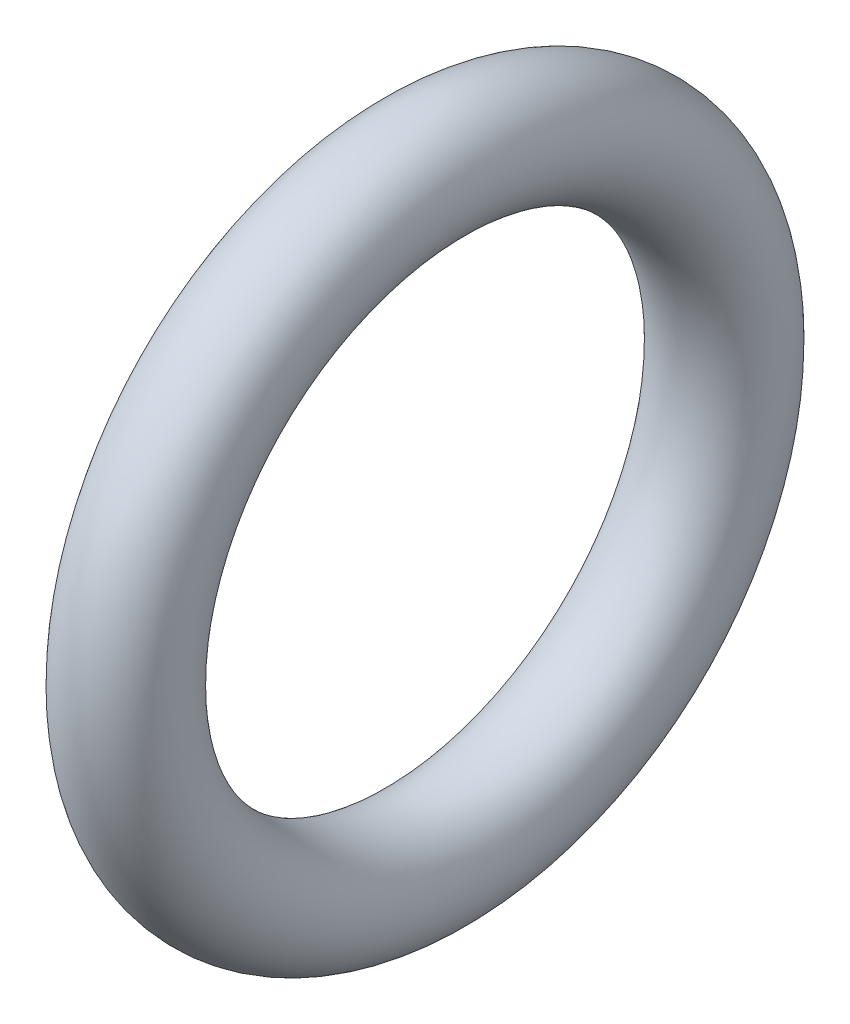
from build123d import *

# Parameters (mm, degrees)
SKETCH1_R = 0.889


with BuildPart() as part:
    # Sketch1 → Base-Revolve (revolve)
    with BuildSketch(Plane.XY, mode=Mode.PRIVATE) as base_revolve_sk:
        with Locations((0, 4.7117)):
            Circle(SKETCH1_R)
    revolve(base_revolve_sk.sketch.rotate(Axis((0, 0, 0), (1, 0, 0)), 90), axis=Axis((0, 0, 0), (1, 0, 0)))


solid = part.part
